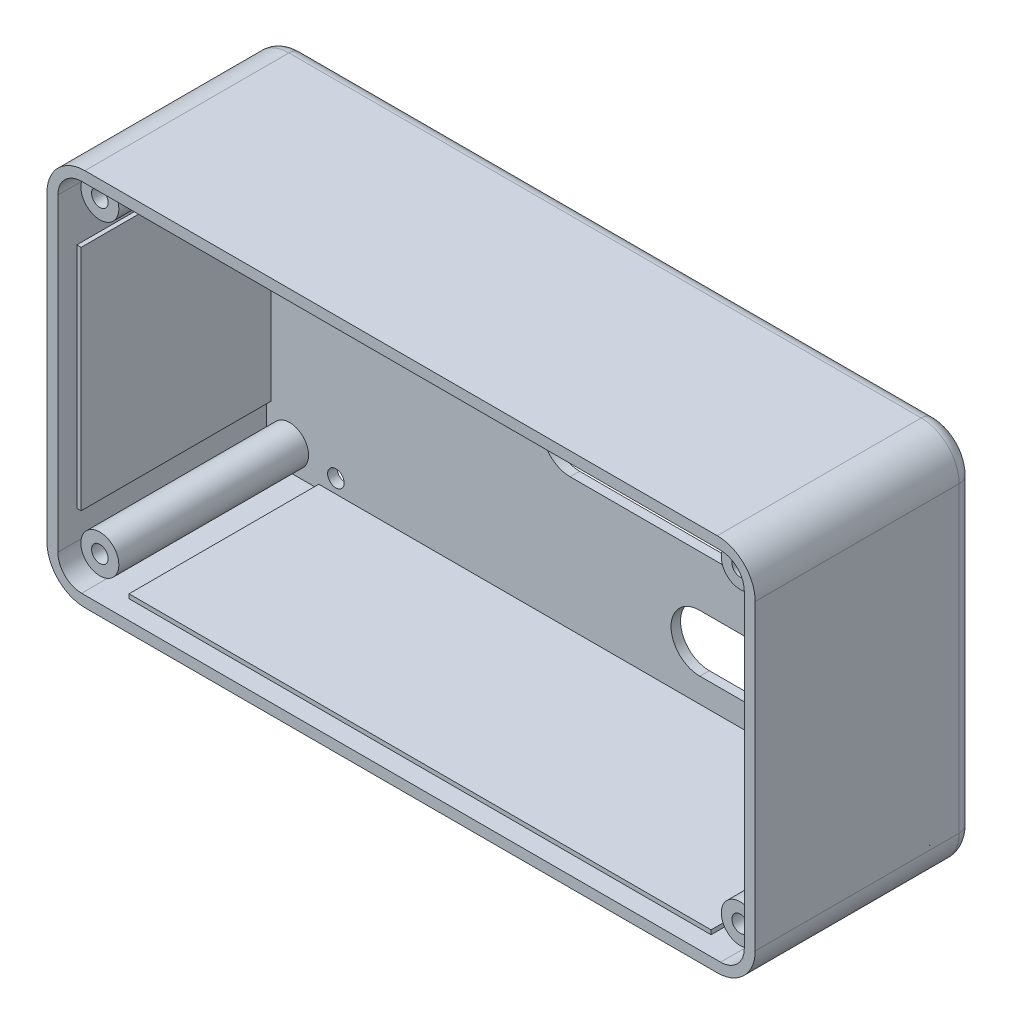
from build123d import *

# Parameters (mm, degrees)
EXTRUSION1_DEPTH        = 46
CONG_1_R                = 3
ENL_V_MAT_EXTRU_1_DEPTH = 4
ESQUISSE3_OUTSIDE_W     = 186.386
ESQUISSE3_OUTSIDE_H     = 116.886
ENL_V_MAT_EXTRU_4_DEPTH = 40
ESQUISSE4_R             = 4
ESQUISSE4_R_2           = 1.75
EXTRUSION2_DEPTH        = 40
ESQUISSE5_R             = 1.75
ENL_V_MAT_EXTRU_5_DEPTH = 5


with BuildPart() as part:
    # Esquisse1 → Extrusion1 (new body)
    with BuildSketch(Plane.XY):
        with BuildLine():
            Line((-66.65, 39.9), (66.65, 39.9))
            ThreePointArc((66.65, 39.9), (72.306854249, 37.556854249), (74.65, 31.9))
            Line((74.65, 31.9), (74.65, -31.9))
            ThreePointArc((74.65, -31.9), (72.306854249, -37.556854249), (66.65, -39.9))
            Line((66.65, -39.9), (-66.65, -39.9))
            ThreePointArc((-66.65, -39.9), (-72.306854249, -37.556854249), (-74.65, -31.9))
            Line((-74.65, -31.9), (-74.65, 31.9))
            ThreePointArc((-74.65, 31.9), (-72.306854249, 37.556854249), (-66.65, 39.9))
        make_face()
    extrude(amount=EXTRUSION1_DEPTH)

    # Cong_1
    cong_1_edges = [part.edges().sort_by_distance(p)[0] for p in [
        (0, 39.9, 0),
        (72.306854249, 37.556854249, 0),
        (74.65, 0, 0),
        (72.306854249, -37.556854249, 0),
        (0, -39.9, 0),
        (-72.306854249, -37.556854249, 0),
        (-74.65, 0, 0),
        (-72.306854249, 37.556854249, 0),
    ]]
    fillet(cong_1_edges, radius=CONG_1_R)

    # Esquisse2 → Enl_v. mat.-Extru.1 (cut)
    with BuildSketch(Plane.XY.offset(46)):
        with BuildLine():
            Line((-67.35, 37.6), (67.35, 37.6))
            ThreePointArc((67.35, 37.6), (70.885533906, 36.135533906), (72.35, 32.6))
            Line((72.35, 32.6), (72.35, -32.6))
            ThreePointArc((72.35, -32.6), (70.885533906, -36.135533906), (67.35, -37.6))
            Line((67.35, -37.6), (-67.35, -37.6))
            ThreePointArc((-67.35, -37.6), (-70.885533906, -36.135533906), (-72.35, -32.6))
            Line((-72.35, -32.6), (-72.35, 32.6))
            ThreePointArc((-72.35, 32.6), (-70.885533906, 36.135533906), (-67.35, 37.6))
        make_face()
    extrude(amount=-ENL_V_MAT_EXTRU_1_DEPTH, mode=Mode.SUBTRACT)

    # Esquisse3 outside → Enl_v. mat.-Extru.4 (cut)
    # profile 1 of 2: a face of its own
    with BuildSketch(Plane.XY.offset(42)):
        Rectangle(ESQUISSE3_OUTSIDE_W, ESQUISSE3_OUTSIDE_H)
        with BuildLine():
            Line((-74.65, 31.9), (-74.65, -31.9))
            ThreePointArc((-74.65, -31.9), (-72.306854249, -37.556854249), (-66.65, -39.9))
            Line((-66.65, -39.9), (66.65, -39.9))
            ThreePointArc((66.65, -39.9), (72.306854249, -37.556854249), (74.65, -31.9))
            Line((74.65, -31.9), (74.65, 31.9))
            ThreePointArc((74.65, 31.9), (72.306854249, 37.556854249), (66.65, 39.9))
            Line((66.65, 39.9), (-66.65, 39.9))
            ThreePointArc((-66.65, 39.9), (-72.306854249, 37.556854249), (-74.65, 31.9))
        make_face(mode=Mode.SUBTRACT)
    # profile 2 of 2: a face of its own
    with BuildSketch(Plane.XY.offset(42)):
        with BuildLine():
            Line((-61.35, 37.6), (-61.35, 36.7))
            Line((-61.35, 36.7), (61.35, 36.7))
            Line((61.35, 36.7), (61.35, 37.6))
            Line((61.35, 37.6), (67.35, 37.6))
            ThreePointArc((67.35, 37.6), (70.885533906, 36.135533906), (72.35, 32.6))
            Line((72.35, 32.6), (72.35, 21.5))
            Line((72.35, 21.5), (71.45, 21.5))
            Line((71.45, 21.5), (71.45, -26.6))
            Line((71.45, -26.6), (72.35, -26.6))
            Line((72.35, -26.6), (72.35, -32.6))
            ThreePointArc((72.35, -32.6), (70.885533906, -36.135533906), (67.35, -37.6))
            Line((67.35, -37.6), (61.35, -37.6))
            Line((61.35, -37.6), (61.35, -36.7))
            Line((61.35, -36.7), (-61.35, -36.7))
            Line((-61.35, -36.7), (-61.35, -37.6))
            Line((-61.35, -37.6), (-67.35, -37.6))
            ThreePointArc((-67.35, -37.6), (-70.885533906, -36.135533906), (-72.35, -32.6))
            Line((-72.35, -32.6), (-72.35, -26.6))
            Line((-72.35, -26.6), (-71.45, -26.6))
            Line((-71.45, -26.6), (-71.45, 21.5))
            Line((-71.45, 21.5), (-72.35, 21.5))
            Line((-72.35, 21.5), (-72.35, 32.6))
            ThreePointArc((-72.35, 32.6), (-70.885533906, 36.135533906), (-67.35, 37.6))
            Line((-67.35, 37.6), (-61.35, 37.6))
        make_face()
    extrude(amount=-ENL_V_MAT_EXTRU_4_DEPTH, mode=Mode.SUBTRACT)

    # Esquisse4 → Extrusion2 (add)
    # profile 1 of 4: a face of its own
    with BuildSketch(Plane.XY.offset(2)):
        with Locations(Location((-67.5, 32.5, 0), (0, 0, 180))):
            Circle(ESQUISSE4_R)
        with Locations((-67.5, 32.5)):
            Circle(ESQUISSE4_R_2, mode=Mode.SUBTRACT)
    # profile 2 of 4: a face of its own
    with BuildSketch(Plane.XY.offset(2)):
        with Locations(Location((-67.5, -32.5, 0), (0, 0, 180))):
            Circle(ESQUISSE4_R)
        with Locations((-67.5, -32.5)):
            Circle(ESQUISSE4_R_2, mode=Mode.SUBTRACT)
    # profile 3 of 4: a face of its own
    with BuildSketch(Plane.XY.offset(2)):
        with Locations(Location((67.5, -32.5, 0), (0, 0, 180))):
            Circle(ESQUISSE4_R)
        with Locations((67.5, -32.5)):
            Circle(ESQUISSE4_R_2, mode=Mode.SUBTRACT)
    # profile 4 of 4: a face of its own
    with BuildSketch(Plane.XY.offset(2)):
        with Locations(Location((67.5, 32.5, 0), (0, 0, 180))):
            Circle(ESQUISSE4_R)
        with Locations((67.5, 32.5)):
            Circle(ESQUISSE4_R_2, mode=Mode.SUBTRACT)
    extrude(amount=EXTRUSION2_DEPTH)

    # Esquisse5 → Enl_v. mat.-Extru.5 (cut)
    with BuildSketch(Plane(origin=(0, 0, 0), x_dir=(-1, 0, 0), z_dir=(0, 0, -1))):
        with Locations((-59.65, 32.9)):
            Circle(ESQUISSE5_R)
        with Locations((57.74, 31.949999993)):
            Circle(ESQUISSE5_R)
        with Locations((57.74, -33.820000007)):
            Circle(ESQUISSE5_R)
        with Locations((-59.79, -34.63)):
            Circle(ESQUISSE5_R)
        with BuildLine():
            Line((29.952506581, 33.869937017), (48.952179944, 33.869937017))
            ThreePointArc((48.952179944, 33.869937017), (54.979933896, 27.897489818), (49.007156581, 21.87006297))
            Line((49.007156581, 21.87006297), (30.007487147, 21.87006297))
            ThreePointArc((30.007487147, 21.87006297), (23.98005984, 27.84250971), (29.952506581, 33.869937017))
        make_face()
        with BuildLine():
            Line((-36.333099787, 29.9299857), (4.663957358, 29.9299857))
            ThreePointArc((4.663957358, 29.9299857), (10.679983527, 23.942657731), (4.68925854, 17.930014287))
            Line((4.68925854, 17.930014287), (-36.306906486, 17.930014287))
            ThreePointArc((-36.306906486, 17.930014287), (-42.319988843, 23.916903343), (-36.333099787, 29.9299857))
        make_face()
        with BuildLine():
            Line((-32.66309665, 3.159985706), (8.333960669, 3.159985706))
            ThreePointArc((8.333960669, 3.159985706), (14.349983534, -2.827345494), (8.359255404, -8.83998572))
            Line((8.359255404, -8.83998572), (-32.636909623, -8.83998572))
            ThreePointArc((-32.636909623, -8.83998572), (-38.64998885, -2.853093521), (-32.66309665, 3.159985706))
        make_face()
        with BuildLine():
            Line((-46.832297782, -19.570503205), (-18.832297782, -19.570503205))
            ThreePointArc((-18.832297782, -19.570503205), (-12.910506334, -25.647705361), (-18.987708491, -31.569496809))
            Line((-18.987708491, -31.569496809), (-46.832297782, -31.569496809))
            ThreePointArc((-46.832297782, -31.569496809), (-52.910003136, -25.570000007), (-46.832297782, -19.570503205))
        make_face()
    extrude(amount=-ENL_V_MAT_EXTRU_5_DEPTH, mode=Mode.SUBTRACT)


solid = part.part
